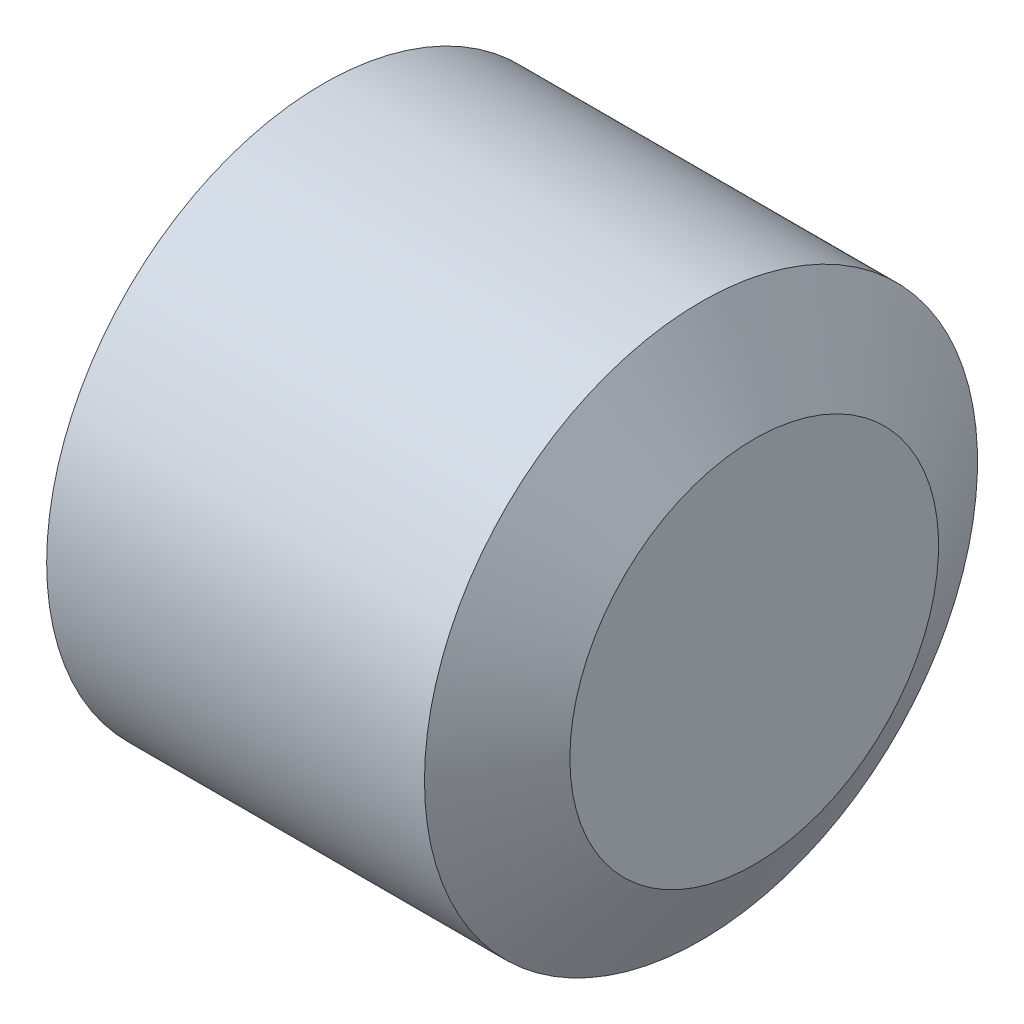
ISO-10303-21;
HEADER;
FILE_DESCRIPTION(('STEP AP214'),'2;1');
FILE_NAME('part.step','',(''),(''),'','','');
FILE_SCHEMA(('AUTOMOTIVE_DESIGN { 1 0 10303 214 1 1 1 1 }'));
ENDSEC;
DATA;
#1=APPLICATION_CONTEXT('core data for automotive mechanical design processes');
#2=APPLICATION_PROTOCOL_DEFINITION('international standard','automotive_design',2000,#1);
#3=PRODUCT_CONTEXT('',#1,'mechanical');
#4=PRODUCT('Part','Part','',(#3));
#5=PRODUCT_RELATED_PRODUCT_CATEGORY('part','',(#4));
#6=PRODUCT_DEFINITION_FORMATION('','',#4);
#7=PRODUCT_DEFINITION_CONTEXT('part definition',#1,'design');
#8=PRODUCT_DEFINITION('design','',#6,#7);
#9=PRODUCT_DEFINITION_SHAPE('','',#8);
#10=(LENGTH_UNIT() NAMED_UNIT(*) SI_UNIT(.MILLI.,.METRE.));
#11=(NAMED_UNIT(*) PLANE_ANGLE_UNIT() SI_UNIT($,.RADIAN.));
#12=(NAMED_UNIT(*) SI_UNIT($,.STERADIAN.) SOLID_ANGLE_UNIT());
#13=UNCERTAINTY_MEASURE_WITH_UNIT(LENGTH_MEASURE(1.E-05),#10,'distance_accuracy_value','');
#14=(GEOMETRIC_REPRESENTATION_CONTEXT(3) GLOBAL_UNCERTAINTY_ASSIGNED_CONTEXT((#13)) GLOBAL_UNIT_ASSIGNED_CONTEXT((#10,
#11,#12)) REPRESENTATION_CONTEXT('',''));
#15=CARTESIAN_POINT('',(0.,0.,0.));
#16=DIRECTION('',(0.,0.,1.));
#17=DIRECTION('',(1.,0.,0.));
#18=AXIS2_PLACEMENT_3D('',#15,#16,#17);
#19=CARTESIAN_POINT('',(0.,0.,0.));
#20=DIRECTION('',(-1.,0.,0.));
#21=DIRECTION('',(0.,0.,1.));
#22=AXIS2_PLACEMENT_3D('',#19,#20,#21);
#23=PLANE('',#22);
#24=CARTESIAN_POINT('',(0.,0.,0.));
#25=DIRECTION('',(-1.,0.,0.));
#26=DIRECTION('',(0.,0.,1.));
#27=AXIS2_PLACEMENT_3D('',#24,#25,#26);
#28=CIRCLE('',#27,1.2195);
#29=CARTESIAN_POINT('',(0.,0.,1.2195));
#30=VERTEX_POINT('',#29);
#31=EDGE_CURVE('E138',#30,#30,#28,.T.);
#32=ORIENTED_EDGE('',*,*,#31,.T.);
#33=EDGE_LOOP('',(#32));
#34=FACE_BOUND('',#33,.T.);
#35=DIRECTION('',(0.,0.,-1.));
#36=VECTOR('',#35,1.);
#37=CARTESIAN_POINT('',(0.,0.750000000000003,0.433012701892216));
#38=LINE('',#37,#36);
#39=CARTESIAN_POINT('',(0.,0.750000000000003,0.433012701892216));
#40=VERTEX_POINT('',#39);
#41=CARTESIAN_POINT('',(0.,0.750000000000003,-0.433012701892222));
#42=VERTEX_POINT('',#41);
#43=EDGE_CURVE('E129',#40,#42,#38,.T.);
#44=ORIENTED_EDGE('',*,*,#43,.F.);
#45=DIRECTION('',(0.,-0.866025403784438,0.500000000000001));
#46=VECTOR('',#45,1.);
#47=CARTESIAN_POINT('',(0.,0.750000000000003,0.433012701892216));
#48=LINE('',#47,#46);
#49=CARTESIAN_POINT('',(0.,0.,0.866025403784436));
#50=VERTEX_POINT('',#49);
#51=EDGE_CURVE('E51',#40,#50,#48,.T.);
#52=ORIENTED_EDGE('',*,*,#51,.T.);
#53=DIRECTION('',(0.,0.866025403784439,0.5));
#54=VECTOR('',#53,1.);
#55=CARTESIAN_POINT('',(0.,-0.749999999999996,0.433012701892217));
#56=LINE('',#55,#54);
#57=CARTESIAN_POINT('',(0.,-0.749999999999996,0.433012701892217));
#58=VERTEX_POINT('',#57);
#59=EDGE_CURVE('E120',#58,#50,#56,.T.);
#60=ORIENTED_EDGE('',*,*,#59,.F.);
#61=DIRECTION('',(0.,0.,-1.));
#62=VECTOR('',#61,1.);
#63=CARTESIAN_POINT('',(0.,-0.749999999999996,0.433012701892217));
#64=LINE('',#63,#62);
#65=CARTESIAN_POINT('',(0.,-0.749999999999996,-0.433012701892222));
#66=VERTEX_POINT('',#65);
#67=EDGE_CURVE('E123',#58,#66,#64,.T.);
#68=ORIENTED_EDGE('',*,*,#67,.T.);
#69=DIRECTION('',(0.,0.866025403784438,-0.500000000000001));
#70=VECTOR('',#69,1.);
#71=CARTESIAN_POINT('',(0.,-0.749999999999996,-0.433012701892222));
#72=LINE('',#71,#70);
#73=CARTESIAN_POINT('',(0.,0.,-0.866025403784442));
#74=VERTEX_POINT('',#73);
#75=EDGE_CURVE('E126',#66,#74,#72,.T.);
#76=ORIENTED_EDGE('',*,*,#75,.T.);
#77=DIRECTION('',(0.,-0.866025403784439,-0.5));
#78=VECTOR('',#77,1.);
#79=CARTESIAN_POINT('',(0.,0.750000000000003,-0.433012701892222));
#80=LINE('',#79,#78);
#81=EDGE_CURVE('E109',#42,#74,#80,.T.);
#82=ORIENTED_EDGE('',*,*,#81,.F.);
#83=EDGE_LOOP('',(#44,#52,#60,#68,#76,#82));
#84=FACE_BOUND('',#83,.T.);
#85=ADVANCED_FACE('F36',(#34,#84),#23,.T.);
#86=CARTESIAN_POINT('',(2.5,1.,0.));
#87=DIRECTION('',(1.,0.,0.));
#88=DIRECTION('',(0.,0.,-1.));
#89=AXIS2_PLACEMENT_3D('',#86,#87,#88);
#90=PLANE('',#89);
#91=CARTESIAN_POINT('',(2.5,0.,0.));
#92=DIRECTION('',(-1.,0.,0.));
#93=DIRECTION('',(0.,0.,1.));
#94=AXIS2_PLACEMENT_3D('',#91,#92,#93);
#95=CIRCLE('',#94,1.);
#96=CARTESIAN_POINT('',(2.5,0.,1.));
#97=VERTEX_POINT('',#96);
#98=EDGE_CURVE('E11',#97,#97,#95,.T.);
#99=ORIENTED_EDGE('',*,*,#98,.F.);
#100=EDGE_LOOP('',(#99));
#101=FACE_BOUND('',#100,.T.);
#102=ADVANCED_FACE('F38',(#101),#90,.T.);
#103=CARTESIAN_POINT('',(2.21132486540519,0.,0.));
#104=DIRECTION('',(-1.,0.,0.));
#105=DIRECTION('',(0.,0.,1.));
#106=AXIS2_PLACEMENT_3D('',#103,#104,#105);
#107=CONICAL_SURFACE('',#106,1.5,1.0471975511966);
#108=ORIENTED_EDGE('',*,*,#98,.T.);
#109=EDGE_LOOP('',(#108));
#110=FACE_BOUND('',#109,.T.);
#111=CARTESIAN_POINT('',(2.21132486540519,0.,0.));
#112=DIRECTION('',(-1.,0.,0.));
#113=DIRECTION('',(0.,0.,1.));
#114=AXIS2_PLACEMENT_3D('',#111,#112,#113);
#115=CIRCLE('',#114,1.5);
#116=CARTESIAN_POINT('',(2.21132486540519,0.,1.5));
#117=VERTEX_POINT('',#116);
#118=EDGE_CURVE('E44',#117,#117,#115,.T.);
#119=ORIENTED_EDGE('',*,*,#118,.F.);
#120=EDGE_LOOP('',(#119));
#121=FACE_BOUND('',#120,.T.);
#122=ADVANCED_FACE('F149',(#110,#121),#107,.T.);
#123=CARTESIAN_POINT('',(-12.7,0.,0.));
#124=DIRECTION('',(-1.,0.,0.));
#125=DIRECTION('',(0.,0.,1.));
#126=AXIS2_PLACEMENT_3D('',#123,#124,#125);
#127=CYLINDRICAL_SURFACE('',#126,1.5);
#128=ORIENTED_EDGE('',*,*,#118,.T.);
#129=EDGE_LOOP('',(#128));
#130=FACE_BOUND('',#129,.T.);
#131=CARTESIAN_POINT('',(0.161946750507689,0.,0.));
#132=DIRECTION('',(-1.,0.,0.));
#133=DIRECTION('',(0.,0.,1.));
#134=AXIS2_PLACEMENT_3D('',#131,#132,#133);
#135=CIRCLE('',#134,1.5);
#136=CARTESIAN_POINT('',(0.161946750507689,0.,1.5));
#137=VERTEX_POINT('',#136);
#138=EDGE_CURVE('E141',#137,#137,#135,.T.);
#139=ORIENTED_EDGE('',*,*,#138,.F.);
#140=EDGE_LOOP('',(#139));
#141=FACE_BOUND('',#140,.T.);
#142=ADVANCED_FACE('F146',(#130,#141),#127,.T.);
#143=CARTESIAN_POINT('',(0.,0.,0.));
#144=DIRECTION('',(1.,0.,0.));
#145=DIRECTION('',(0.,0.,-1.));
#146=AXIS2_PLACEMENT_3D('',#143,#144,#145);
#147=CONICAL_SURFACE('',#146,1.2195,1.0471975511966);
#148=ORIENTED_EDGE('',*,*,#138,.T.);
#149=EDGE_LOOP('',(#148));
#150=FACE_BOUND('',#149,.T.);
#151=ORIENTED_EDGE('',*,*,#31,.F.);
#152=EDGE_LOOP('',(#151));
#153=FACE_BOUND('',#152,.T.);
#154=ADVANCED_FACE('F156',(#150,#153),#147,.T.);
#155=CARTESIAN_POINT('',(1.1,0.750000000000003,0.433012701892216));
#156=DIRECTION('',(0.,-0.500000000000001,-0.866025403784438));
#157=DIRECTION('',(0.,0.866025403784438,-0.500000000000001));
#158=AXIS2_PLACEMENT_3D('',#155,#156,#157);
#159=PLANE('',#158);
#160=ORIENTED_EDGE('',*,*,#51,.F.);
#161=DIRECTION('',(-1.,0.,0.));
#162=VECTOR('',#161,1.);
#163=CARTESIAN_POINT('',(1.1,0.750000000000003,0.433012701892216));
#164=LINE('',#163,#162);
#165=CARTESIAN_POINT('',(1.1,0.750000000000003,0.433012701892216));
#166=VERTEX_POINT('',#165);
#167=EDGE_CURVE('E56',#166,#40,#164,.T.);
#168=ORIENTED_EDGE('',*,*,#167,.F.);
#169=DIRECTION('',(0.,-0.866025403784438,0.500000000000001));
#170=VECTOR('',#169,1.);
#171=CARTESIAN_POINT('',(1.1,0.750000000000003,0.433012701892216));
#172=LINE('',#171,#170);
#173=CARTESIAN_POINT('',(1.1,0.,0.866025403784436));
#174=VERTEX_POINT('',#173);
#175=EDGE_CURVE('E83',#166,#174,#172,.T.);
#176=ORIENTED_EDGE('',*,*,#175,.T.);
#177=DIRECTION('',(-1.,0.,0.));
#178=VECTOR('',#177,1.);
#179=CARTESIAN_POINT('',(1.1,0.,0.866025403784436));
#180=LINE('',#179,#178);
#181=EDGE_CURVE('E136',#174,#50,#180,.T.);
#182=ORIENTED_EDGE('',*,*,#181,.T.);
#183=EDGE_LOOP('',(#160,#168,#176,#182));
#184=FACE_BOUND('',#183,.T.);
#185=ADVANCED_FACE('F167',(#184),#159,.T.);
#186=CARTESIAN_POINT('',(1.1,-0.749999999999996,0.433012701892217));
#187=DIRECTION('',(0.,-0.5,0.866025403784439));
#188=DIRECTION('',(0.,-0.866025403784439,-0.5));
#189=AXIS2_PLACEMENT_3D('',#186,#187,#188);
#190=PLANE('',#189);
#191=ORIENTED_EDGE('',*,*,#59,.T.);
#192=ORIENTED_EDGE('',*,*,#181,.F.);
#193=DIRECTION('',(0.,0.866025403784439,0.5));
#194=VECTOR('',#193,1.);
#195=CARTESIAN_POINT('',(1.1,-0.749999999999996,0.433012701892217));
#196=LINE('',#195,#194);
#197=CARTESIAN_POINT('',(1.1,-0.749999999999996,0.433012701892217));
#198=VERTEX_POINT('',#197);
#199=EDGE_CURVE('E269',#198,#174,#196,.T.);
#200=ORIENTED_EDGE('',*,*,#199,.F.);
#201=DIRECTION('',(-1.,0.,0.));
#202=VECTOR('',#201,1.);
#203=CARTESIAN_POINT('',(1.1,-0.749999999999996,0.433012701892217));
#204=LINE('',#203,#202);
#205=EDGE_CURVE('E134',#198,#58,#204,.T.);
#206=ORIENTED_EDGE('',*,*,#205,.T.);
#207=EDGE_LOOP('',(#191,#192,#200,#206));
#208=FACE_BOUND('',#207,.T.);
#209=ADVANCED_FACE('F174',(#208),#190,.F.);
#210=CARTESIAN_POINT('',(1.1,-0.749999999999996,0.433012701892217));
#211=DIRECTION('',(0.,1.,0.));
#212=DIRECTION('',(0.,0.,1.));
#213=AXIS2_PLACEMENT_3D('',#210,#211,#212);
#214=PLANE('',#213);
#215=ORIENTED_EDGE('',*,*,#67,.F.);
#216=ORIENTED_EDGE('',*,*,#205,.F.);
#217=DIRECTION('',(0.,0.,-1.));
#218=VECTOR('',#217,1.);
#219=CARTESIAN_POINT('',(1.1,-0.749999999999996,0.433012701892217));
#220=LINE('',#219,#218);
#221=CARTESIAN_POINT('',(1.1,-0.749999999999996,-0.433012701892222));
#222=VERTEX_POINT('',#221);
#223=EDGE_CURVE('E104',#198,#222,#220,.T.);
#224=ORIENTED_EDGE('',*,*,#223,.T.);
#225=DIRECTION('',(-1.,0.,0.));
#226=VECTOR('',#225,1.);
#227=CARTESIAN_POINT('',(1.1,-0.749999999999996,-0.433012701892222));
#228=LINE('',#227,#226);
#229=EDGE_CURVE('E99',#222,#66,#228,.T.);
#230=ORIENTED_EDGE('',*,*,#229,.T.);
#231=EDGE_LOOP('',(#215,#216,#224,#230));
#232=FACE_BOUND('',#231,.T.);
#233=ADVANCED_FACE('F181',(#232),#214,.T.);
#234=CARTESIAN_POINT('',(1.1,-0.749999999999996,-0.433012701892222));
#235=DIRECTION('',(0.,0.500000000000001,0.866025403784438));
#236=DIRECTION('',(0.,-0.866025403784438,0.500000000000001));
#237=AXIS2_PLACEMENT_3D('',#234,#235,#236);
#238=PLANE('',#237);
#239=ORIENTED_EDGE('',*,*,#75,.F.);
#240=ORIENTED_EDGE('',*,*,#229,.F.);
#241=DIRECTION('',(0.,0.866025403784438,-0.500000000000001));
#242=VECTOR('',#241,1.);
#243=CARTESIAN_POINT('',(1.1,-0.749999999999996,-0.433012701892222));
#244=LINE('',#243,#242);
#245=CARTESIAN_POINT('',(1.1,0.,-0.866025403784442));
#246=VERTEX_POINT('',#245);
#247=EDGE_CURVE('E94',#222,#246,#244,.T.);
#248=ORIENTED_EDGE('',*,*,#247,.T.);
#249=DIRECTION('',(-1.,0.,0.));
#250=VECTOR('',#249,1.);
#251=CARTESIAN_POINT('',(1.1,0.,-0.866025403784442));
#252=LINE('',#251,#250);
#253=EDGE_CURVE('E98',#246,#74,#252,.T.);
#254=ORIENTED_EDGE('',*,*,#253,.T.);
#255=EDGE_LOOP('',(#239,#240,#248,#254));
#256=FACE_BOUND('',#255,.T.);
#257=ADVANCED_FACE('F97',(#256),#238,.T.);
#258=CARTESIAN_POINT('',(1.1,0.750000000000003,-0.433012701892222));
#259=DIRECTION('',(0.,0.5,-0.866025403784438));
#260=DIRECTION('',(0.,0.866025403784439,0.5));
#261=AXIS2_PLACEMENT_3D('',#258,#259,#260);
#262=PLANE('',#261);
#263=ORIENTED_EDGE('',*,*,#81,.T.);
#264=ORIENTED_EDGE('',*,*,#253,.F.);
#265=DIRECTION('',(0.,-0.866025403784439,-0.5));
#266=VECTOR('',#265,1.);
#267=CARTESIAN_POINT('',(1.1,0.750000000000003,-0.433012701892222));
#268=LINE('',#267,#266);
#269=CARTESIAN_POINT('',(1.1,0.750000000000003,-0.433012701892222));
#270=VERTEX_POINT('',#269);
#271=EDGE_CURVE('E103',#270,#246,#268,.T.);
#272=ORIENTED_EDGE('',*,*,#271,.F.);
#273=DIRECTION('',(-1.,0.,0.));
#274=VECTOR('',#273,1.);
#275=CARTESIAN_POINT('',(1.1,0.750000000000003,-0.433012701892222));
#276=LINE('',#275,#274);
#277=EDGE_CURVE('E79',#270,#42,#276,.T.);
#278=ORIENTED_EDGE('',*,*,#277,.T.);
#279=EDGE_LOOP('',(#263,#264,#272,#278));
#280=FACE_BOUND('',#279,.T.);
#281=ADVANCED_FACE('F106',(#280),#262,.F.);
#282=CARTESIAN_POINT('',(1.1,0.750000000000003,0.433012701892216));
#283=DIRECTION('',(0.,1.,0.));
#284=DIRECTION('',(0.,0.,1.));
#285=AXIS2_PLACEMENT_3D('',#282,#283,#284);
#286=PLANE('',#285);
#287=ORIENTED_EDGE('',*,*,#43,.T.);
#288=ORIENTED_EDGE('',*,*,#277,.F.);
#289=DIRECTION('',(0.,0.,-1.));
#290=VECTOR('',#289,1.);
#291=CARTESIAN_POINT('',(1.1,0.750000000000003,0.433012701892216));
#292=LINE('',#291,#290);
#293=EDGE_CURVE('E114',#166,#270,#292,.T.);
#294=ORIENTED_EDGE('',*,*,#293,.F.);
#295=ORIENTED_EDGE('',*,*,#167,.T.);
#296=EDGE_LOOP('',(#287,#288,#294,#295));
#297=FACE_BOUND('',#296,.T.);
#298=ADVANCED_FACE('F193',(#297),#286,.F.);
#299=CARTESIAN_POINT('',(1.1,1.5,0.));
#300=DIRECTION('',(1.,0.,0.));
#301=DIRECTION('',(0.,0.,-1.));
#302=AXIS2_PLACEMENT_3D('',#299,#300,#301);
#303=PLANE('',#302);
#304=ORIENTED_EDGE('',*,*,#175,.F.);
#305=ORIENTED_EDGE('',*,*,#293,.T.);
#306=ORIENTED_EDGE('',*,*,#271,.T.);
#307=ORIENTED_EDGE('',*,*,#247,.F.);
#308=ORIENTED_EDGE('',*,*,#223,.F.);
#309=ORIENTED_EDGE('',*,*,#199,.T.);
#310=EDGE_LOOP('',(#304,#305,#306,#307,#308,#309));
#311=FACE_BOUND('',#310,.T.);
#312=ADVANCED_FACE('F112',(#311),#303,.F.);
#313=CLOSED_SHELL('',(#85,#102,#122,#142,#154,#185,#209,#233,#257,#281,#298,#312));
#314=MANIFOLD_SOLID_BREP('B2',#313);
#315=ADVANCED_BREP_SHAPE_REPRESENTATION('',(#18,#314),#14);
#316=SHAPE_DEFINITION_REPRESENTATION(#9,#315);
ENDSEC;
END-ISO-10303-21;
